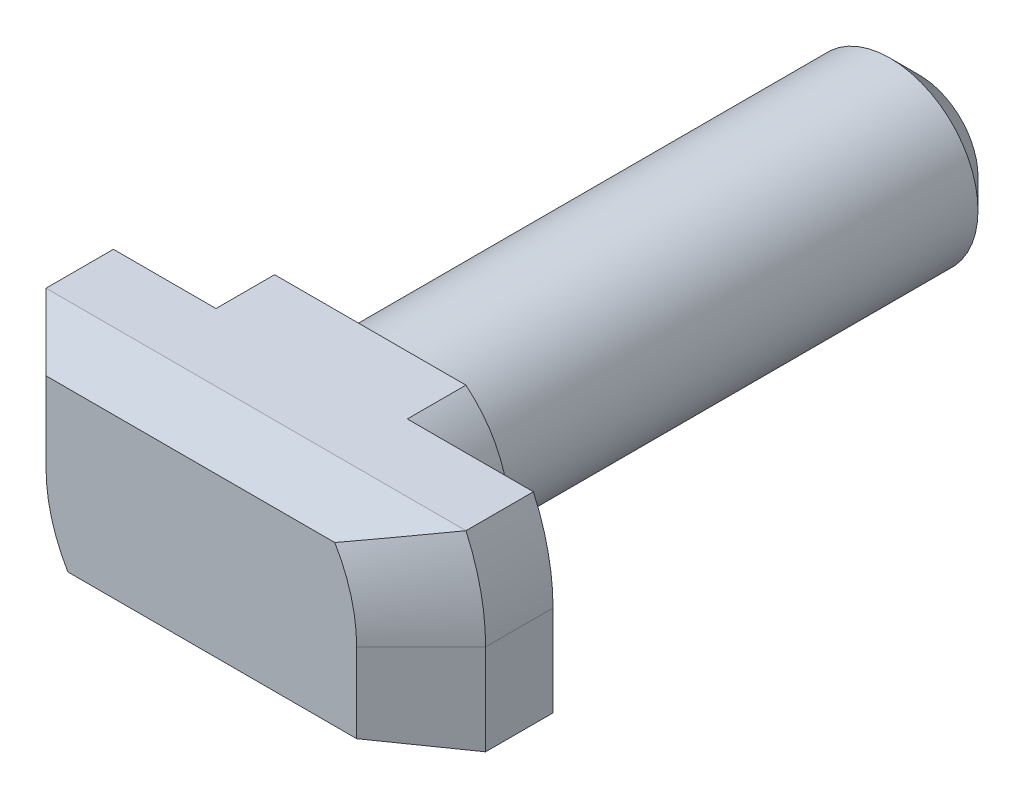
ISO-10303-21;
HEADER;
FILE_DESCRIPTION(('STEP AP214'),'2;1');
FILE_NAME('part.step','',(''),(''),'','','');
FILE_SCHEMA(('AUTOMOTIVE_DESIGN { 1 0 10303 214 1 1 1 1 }'));
ENDSEC;
DATA;
#1=APPLICATION_CONTEXT('core data for automotive mechanical design processes');
#2=APPLICATION_PROTOCOL_DEFINITION('international standard','automotive_design',2000,#1);
#3=PRODUCT_CONTEXT('',#1,'mechanical');
#4=PRODUCT('Part','Part','',(#3));
#5=PRODUCT_RELATED_PRODUCT_CATEGORY('part','',(#4));
#6=PRODUCT_DEFINITION_FORMATION('','',#4);
#7=PRODUCT_DEFINITION_CONTEXT('part definition',#1,'design');
#8=PRODUCT_DEFINITION('design','',#6,#7);
#9=PRODUCT_DEFINITION_SHAPE('','',#8);
#10=(LENGTH_UNIT() NAMED_UNIT(*) SI_UNIT(.MILLI.,.METRE.));
#11=(NAMED_UNIT(*) PLANE_ANGLE_UNIT() SI_UNIT($,.RADIAN.));
#12=(NAMED_UNIT(*) SI_UNIT($,.STERADIAN.) SOLID_ANGLE_UNIT());
#13=UNCERTAINTY_MEASURE_WITH_UNIT(LENGTH_MEASURE(1.E-05),#10,'distance_accuracy_value','');
#14=(GEOMETRIC_REPRESENTATION_CONTEXT(3) GLOBAL_UNCERTAINTY_ASSIGNED_CONTEXT((#13)) GLOBAL_UNIT_ASSIGNED_CONTEXT((#10,
#11,#12)) REPRESENTATION_CONTEXT('',''));
#15=CARTESIAN_POINT('',(0.,0.,0.));
#16=DIRECTION('',(0.,0.,1.));
#17=DIRECTION('',(1.,0.,0.));
#18=AXIS2_PLACEMENT_3D('',#15,#16,#17);
#19=CARTESIAN_POINT('',(5.30000000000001,-3.09999999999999,4.5));
#20=DIRECTION('',(0.707106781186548,0.,0.707106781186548));
#21=DIRECTION('',(0.707106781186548,0.,-0.707106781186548));
#22=AXIS2_PLACEMENT_3D('',#19,#20,#21);
#23=PLANE('',#22);
#24=DIRECTION('',(0.701673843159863,-0.123724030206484,-0.701673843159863));
#25=VECTOR('',#24,1.);
#26=CARTESIAN_POINT('',(5.30000000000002,-2.71208064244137,4.5));
#27=LINE('',#26,#25);
#28=CARTESIAN_POINT('',(5.30000000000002,-2.71208064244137,4.5));
#29=VERTEX_POINT('',#28);
#30=CARTESIAN_POINT('',(7.5,-3.09999999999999,2.3));
#31=VERTEX_POINT('',#30);
#32=EDGE_CURVE('E239',#29,#31,#27,.T.);
#33=ORIENTED_EDGE('',*,*,#32,.T.);
#34=DIRECTION('',(0.,1.,0.));
#35=VECTOR('',#34,1.);
#36=CARTESIAN_POINT('',(7.5,-3.09999999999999,2.30000000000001));
#37=LINE('',#36,#35);
#38=CARTESIAN_POINT('',(7.5,0.,2.30000000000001));
#39=VERTEX_POINT('',#38);
#40=EDGE_CURVE('E241',#39,#31,#37,.F.);
#41=ORIENTED_EDGE('',*,*,#40,.F.);
#42=DIRECTION('',(-0.707106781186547,0.,0.707106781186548));
#43=VECTOR('',#42,1.);
#44=CARTESIAN_POINT('',(7.58485620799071,0.,2.21514379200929));
#45=LINE('',#44,#43);
#46=CARTESIAN_POINT('',(5.30000000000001,0.,4.5));
#47=VERTEX_POINT('',#46);
#48=EDGE_CURVE('E103',#47,#39,#45,.F.);
#49=ORIENTED_EDGE('',*,*,#48,.F.);
#50=DIRECTION('',(0.,-1.,0.));
#51=VECTOR('',#50,1.);
#52=CARTESIAN_POINT('',(5.30000000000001,-3.09999999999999,4.5));
#53=LINE('',#52,#51);
#54=EDGE_CURVE('E271',#29,#47,#53,.F.);
#55=ORIENTED_EDGE('',*,*,#54,.F.);
#56=EDGE_LOOP('',(#33,#41,#49,#55));
#57=FACE_BOUND('',#56,.T.);
#58=ADVANCED_FACE('F16',(#57),#23,.T.);
#59=CARTESIAN_POINT('',(0.,0.,2.30000000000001));
#60=DIRECTION('',(0.,0.,-1.));
#61=DIRECTION('',(0.,1.,0.));
#62=AXIS2_PLACEMENT_3D('',#59,#60,#61);
#63=CONICAL_SURFACE('',#62,7.5,0.785398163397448);
#64=CARTESIAN_POINT('',(-6.82934843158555,-3.09999999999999,2.30000000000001));
#65=CARTESIAN_POINT('',(-6.64116901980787,-3.06741372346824,2.48480595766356));
#66=CARTESIAN_POINT('',(-6.45275253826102,-3.03486855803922,2.66937876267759));
#67=CARTESIAN_POINT('',(-6.07527016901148,-2.96989350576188,3.03787059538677));
#68=CARTESIAN_POINT('',(-5.88620429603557,-2.93746361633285,3.22178963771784));
#69=CARTESIAN_POINT('',(-5.50723735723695,-2.87275034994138,3.58879680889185));
#70=CARTESIAN_POINT('',(-5.31733628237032,-2.84046697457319,3.77188492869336));
#71=CARTESIAN_POINT('',(-4.93637796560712,-2.77610518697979,4.13689876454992));
#72=CARTESIAN_POINT('',(-4.74532069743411,-2.74402677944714,4.31882445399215));
#73=CARTESIAN_POINT('',(-4.55352814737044,-2.71208064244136,4.5));
#74=B_SPLINE_CURVE_WITH_KNOTS('',3,(#64,#65,#66,#67,#68,#69,#70,#71,#72,#73),.UNSPECIFIED.,.F.,
.F.,(4,2,2,2,4),(0.,0.797270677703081,1.59452339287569,2.39178476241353,3.1890643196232),.UNSPECIFIED.);
#75=CARTESIAN_POINT('',(-6.82934843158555,-3.09999999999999,2.30000000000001));
#76=VERTEX_POINT('',#75);
#77=CARTESIAN_POINT('',(-4.55352814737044,-2.71208064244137,4.5));
#78=VERTEX_POINT('',#77);
#79=EDGE_CURVE('E236',#76,#78,#74,.T.);
#80=ORIENTED_EDGE('',*,*,#79,.T.);
#81=CARTESIAN_POINT('',(0.,0.,4.5));
#82=DIRECTION('',(0.,0.,-1.));
#83=DIRECTION('',(0.,1.,0.));
#84=AXIS2_PLACEMENT_3D('',#81,#82,#83);
#85=CIRCLE('',#84,5.30000000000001);
#86=CARTESIAN_POINT('',(-5.3,0.,4.5));
#87=VERTEX_POINT('',#86);
#88=EDGE_CURVE('E19',#87,#78,#85,.F.);
#89=ORIENTED_EDGE('',*,*,#88,.F.);
#90=DIRECTION('',(0.707106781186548,0.,0.707106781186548));
#91=VECTOR('',#90,1.);
#92=CARTESIAN_POINT('',(-7.5,0.,2.3));
#93=LINE('',#92,#91);
#94=CARTESIAN_POINT('',(-7.5,0.,2.30000000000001));
#95=VERTEX_POINT('',#94);
#96=EDGE_CURVE('E268',#95,#87,#93,.T.);
#97=ORIENTED_EDGE('',*,*,#96,.F.);
#98=CARTESIAN_POINT('',(0.,0.,2.30000000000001));
#99=DIRECTION('',(0.,0.,-1.));
#100=DIRECTION('',(0.,1.,0.));
#101=AXIS2_PLACEMENT_3D('',#98,#99,#100);
#102=CIRCLE('',#101,7.5);
#103=EDGE_CURVE('E222',#76,#95,#102,.T.);
#104=ORIENTED_EDGE('',*,*,#103,.F.);
#105=EDGE_LOOP('',(#80,#89,#97,#104));
#106=FACE_BOUND('',#105,.T.);
#107=ADVANCED_FACE('F328',(#106),#63,.T.);
#108=CARTESIAN_POINT('',(-5.30000000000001,-3.09999999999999,4.5));
#109=DIRECTION('',(0.,0.,1.));
#110=DIRECTION('',(0.,-1.,0.));
#111=AXIS2_PLACEMENT_3D('',#108,#109,#110);
#112=PLANE('',#111);
#113=CARTESIAN_POINT('',(0.,0.,4.5));
#114=DIRECTION('',(0.,0.,-1.));
#115=DIRECTION('',(0.,1.,0.));
#116=AXIS2_PLACEMENT_3D('',#113,#114,#115);
#117=CIRCLE('',#116,5.3);
#118=CARTESIAN_POINT('',(4.55352814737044,2.71208064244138,4.5));
#119=VERTEX_POINT('',#118);
#120=EDGE_CURVE('E282',#119,#47,#117,.T.);
#121=ORIENTED_EDGE('',*,*,#120,.F.);
#122=DIRECTION('',(1.,0.,0.));
#123=VECTOR('',#122,1.);
#124=CARTESIAN_POINT('',(-8.7000480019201,2.71208064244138,4.5));
#125=LINE('',#124,#123);
#126=CARTESIAN_POINT('',(-5.3,2.71208064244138,4.5));
#127=VERTEX_POINT('',#126);
#128=EDGE_CURVE('E191',#127,#119,#125,.T.);
#129=ORIENTED_EDGE('',*,*,#128,.F.);
#130=DIRECTION('',(0.,1.,0.));
#131=VECTOR('',#130,1.);
#132=CARTESIAN_POINT('',(-5.3,-3.09999999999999,4.5));
#133=LINE('',#132,#131);
#134=EDGE_CURVE('E263',#87,#127,#133,.T.);
#135=ORIENTED_EDGE('',*,*,#134,.F.);
#136=ORIENTED_EDGE('',*,*,#88,.T.);
#137=DIRECTION('',(1.,0.,0.));
#138=VECTOR('',#137,1.);
#139=CARTESIAN_POINT('',(-8.02939643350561,-2.71208064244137,4.5));
#140=LINE('',#139,#138);
#141=EDGE_CURVE('E226',#78,#29,#140,.T.);
#142=ORIENTED_EDGE('',*,*,#141,.T.);
#143=ORIENTED_EDGE('',*,*,#54,.T.);
#144=EDGE_LOOP('',(#121,#129,#135,#136,#142,#143));
#145=FACE_BOUND('',#144,.T.);
#146=ADVANCED_FACE('F325',(#145),#112,.T.);
#147=CARTESIAN_POINT('',(0.,0.,2.3));
#148=DIRECTION('',(0.,0.,-1.));
#149=DIRECTION('',(0.,1.,0.));
#150=AXIS2_PLACEMENT_3D('',#147,#148,#149);
#151=CONICAL_SURFACE('',#150,7.5,0.785398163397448);
#152=CARTESIAN_POINT('',(4.55352814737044,2.71208064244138,4.5));
#153=CARTESIAN_POINT('',(4.74532069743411,2.74402677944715,4.31882445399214));
#154=CARTESIAN_POINT('',(4.93637796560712,2.77610518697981,4.13689876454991));
#155=CARTESIAN_POINT('',(5.31733628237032,2.84046697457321,3.77188492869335));
#156=CARTESIAN_POINT('',(5.50723735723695,2.8727503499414,3.58879680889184));
#157=CARTESIAN_POINT('',(5.88620429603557,2.93746361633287,3.22178963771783));
#158=CARTESIAN_POINT('',(6.07527016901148,2.9698935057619,3.03787059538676));
#159=CARTESIAN_POINT('',(6.45275253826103,3.03486855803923,2.66937876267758));
#160=CARTESIAN_POINT('',(6.64116901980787,3.06741372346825,2.48480595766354));
#161=CARTESIAN_POINT('',(6.82934843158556,3.1,2.3));
#162=B_SPLINE_CURVE_WITH_KNOTS('',3,(#152,#153,#154,#155,#156,#157,#158,#159,#160,#161),
.UNSPECIFIED.,.F.,.F.,(4,2,2,2,4),(0.,0.797279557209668,1.59454092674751,2.39179364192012,
3.18906431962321),.UNSPECIFIED.);
#163=CARTESIAN_POINT('',(6.82934843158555,3.1,2.29999999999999));
#164=VERTEX_POINT('',#163);
#165=EDGE_CURVE('E194',#119,#164,#162,.T.);
#166=ORIENTED_EDGE('',*,*,#165,.F.);
#167=ORIENTED_EDGE('',*,*,#120,.T.);
#168=ORIENTED_EDGE('',*,*,#48,.T.);
#169=CARTESIAN_POINT('',(0.,0.,2.3));
#170=DIRECTION('',(0.,0.,-1.));
#171=DIRECTION('',(0.,1.,0.));
#172=AXIS2_PLACEMENT_3D('',#169,#170,#171);
#173=CIRCLE('',#172,7.5);
#174=EDGE_CURVE('E259',#164,#39,#173,.T.);
#175=ORIENTED_EDGE('',*,*,#174,.F.);
#176=EDGE_LOOP('',(#166,#167,#168,#175));
#177=FACE_BOUND('',#176,.T.);
#178=ADVANCED_FACE('F319',(#177),#151,.T.);
#179=CARTESIAN_POINT('',(-7.5,-3.09999999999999,2.3));
#180=DIRECTION('',(-0.707106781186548,0.,0.707106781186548));
#181=DIRECTION('',(0.707106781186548,0.,0.707106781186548));
#182=AXIS2_PLACEMENT_3D('',#179,#180,#181);
#183=PLANE('',#182);
#184=DIRECTION('',(0.701673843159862,-0.123724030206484,0.701673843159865));
#185=VECTOR('',#184,1.);
#186=CARTESIAN_POINT('',(-7.50000000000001,3.1,2.29999999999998));
#187=LINE('',#186,#185);
#188=CARTESIAN_POINT('',(-7.5,3.1,2.29999999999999));
#189=VERTEX_POINT('',#188);
#190=EDGE_CURVE('E178',#189,#127,#187,.T.);
#191=ORIENTED_EDGE('',*,*,#190,.F.);
#192=DIRECTION('',(0.,1.,0.));
#193=VECTOR('',#192,1.);
#194=CARTESIAN_POINT('',(-7.5,3.1,2.30000000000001));
#195=LINE('',#194,#193);
#196=EDGE_CURVE('E204',#95,#189,#195,.T.);
#197=ORIENTED_EDGE('',*,*,#196,.F.);
#198=ORIENTED_EDGE('',*,*,#96,.T.);
#199=ORIENTED_EDGE('',*,*,#134,.T.);
#200=EDGE_LOOP('',(#191,#197,#198,#199));
#201=FACE_BOUND('',#200,.T.);
#202=ADVANCED_FACE('F324',(#201),#183,.T.);
#203=CARTESIAN_POINT('',(7.5,-3.09999999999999,0.5));
#204=DIRECTION('',(1.,0.,0.));
#205=DIRECTION('',(0.,0.,-1.));
#206=AXIS2_PLACEMENT_3D('',#203,#204,#205);
#207=PLANE('',#206);
#208=DIRECTION('',(0.,0.,-1.));
#209=VECTOR('',#208,1.);
#210=CARTESIAN_POINT('',(7.5,-3.09999999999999,0.));
#211=LINE('',#210,#209);
#212=CARTESIAN_POINT('',(7.5,-3.09999999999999,0.));
#213=VERTEX_POINT('',#212);
#214=EDGE_CURVE('E231',#213,#31,#211,.F.);
#215=ORIENTED_EDGE('',*,*,#214,.F.);
#216=DIRECTION('',(0.,-1.,0.));
#217=VECTOR('',#216,1.);
#218=CARTESIAN_POINT('',(7.5,3.1,0.));
#219=LINE('',#218,#217);
#220=CARTESIAN_POINT('',(7.5,0.,0.));
#221=VERTEX_POINT('',#220);
#222=EDGE_CURVE('E175',#213,#221,#219,.F.);
#223=ORIENTED_EDGE('',*,*,#222,.T.);
#224=DIRECTION('',(0.,0.,-1.));
#225=VECTOR('',#224,1.);
#226=CARTESIAN_POINT('',(7.5,0.,0.5));
#227=LINE('',#226,#225);
#228=EDGE_CURVE('E250',#221,#39,#227,.F.);
#229=ORIENTED_EDGE('',*,*,#228,.T.);
#230=ORIENTED_EDGE('',*,*,#40,.T.);
#231=EDGE_LOOP('',(#215,#223,#229,#230));
#232=FACE_BOUND('',#231,.T.);
#233=ADVANCED_FACE('F342',(#232),#207,.T.);
#234=CARTESIAN_POINT('',(-8.02939643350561,-3.09999999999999,2.3));
#235=DIRECTION('',(0.,0.984807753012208,-0.173648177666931));
#236=DIRECTION('',(0.,0.173648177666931,0.984807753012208));
#237=AXIS2_PLACEMENT_3D('',#234,#235,#236);
#238=PLANE('',#237);
#239=ORIENTED_EDGE('',*,*,#79,.F.);
#240=DIRECTION('',(1.,0.,0.));
#241=VECTOR('',#240,1.);
#242=CARTESIAN_POINT('',(-2.52784493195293,-3.09999999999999,2.3));
#243=LINE('',#242,#241);
#244=EDGE_CURVE('E221',#31,#76,#243,.F.);
#245=ORIENTED_EDGE('',*,*,#244,.F.);
#246=ORIENTED_EDGE('',*,*,#32,.F.);
#247=ORIENTED_EDGE('',*,*,#141,.F.);
#248=EDGE_LOOP('',(#239,#245,#246,#247));
#249=FACE_BOUND('',#248,.T.);
#250=ADVANCED_FACE('F337',(#249),#238,.F.);
#251=CARTESIAN_POINT('',(0.,0.,0.5));
#252=DIRECTION('',(0.,0.,-1.));
#253=DIRECTION('',(0.,1.,0.));
#254=AXIS2_PLACEMENT_3D('',#251,#252,#253);
#255=CYLINDRICAL_SURFACE('',#254,7.5);
#256=DIRECTION('',(0.,0.,1.));
#257=VECTOR('',#256,1.);
#258=CARTESIAN_POINT('',(-7.5,0.,0.5));
#259=LINE('',#258,#257);
#260=CARTESIAN_POINT('',(-7.5,0.,0.));
#261=VERTEX_POINT('',#260);
#262=EDGE_CURVE('E207',#261,#95,#259,.T.);
#263=ORIENTED_EDGE('',*,*,#262,.F.);
#264=CARTESIAN_POINT('',(0.,0.,0.));
#265=DIRECTION('',(0.,0.,-1.));
#266=DIRECTION('',(0.,1.,0.));
#267=AXIS2_PLACEMENT_3D('',#264,#265,#266);
#268=CIRCLE('',#267,7.5);
#269=CARTESIAN_POINT('',(-6.82934843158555,-3.09999999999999,0.));
#270=VERTEX_POINT('',#269);
#271=EDGE_CURVE('E225',#261,#270,#268,.F.);
#272=ORIENTED_EDGE('',*,*,#271,.T.);
#273=DIRECTION('',(0.,0.,-1.));
#274=VECTOR('',#273,1.);
#275=CARTESIAN_POINT('',(-6.82934843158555,-3.09999999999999,0.));
#276=LINE('',#275,#274);
#277=EDGE_CURVE('E218',#76,#270,#276,.T.);
#278=ORIENTED_EDGE('',*,*,#277,.F.);
#279=ORIENTED_EDGE('',*,*,#103,.T.);
#280=EDGE_LOOP('',(#263,#272,#278,#279));
#281=FACE_BOUND('',#280,.T.);
#282=ADVANCED_FACE('F341',(#281),#255,.T.);
#283=CARTESIAN_POINT('',(7.5,3.1,0.));
#284=DIRECTION('',(0.,0.,1.));
#285=DIRECTION('',(0.,-1.,0.));
#286=AXIS2_PLACEMENT_3D('',#283,#284,#285);
#287=PLANE('',#286);
#288=ORIENTED_EDGE('',*,*,#271,.F.);
#289=DIRECTION('',(0.,1.,0.));
#290=VECTOR('',#289,1.);
#291=CARTESIAN_POINT('',(-7.5,3.1,0.));
#292=LINE('',#291,#290);
#293=CARTESIAN_POINT('',(-7.5,3.1,0.));
#294=VERTEX_POINT('',#293);
#295=EDGE_CURVE('E143',#294,#261,#292,.F.);
#296=ORIENTED_EDGE('',*,*,#295,.F.);
#297=DIRECTION('',(1.,0.,0.));
#298=VECTOR('',#297,1.);
#299=CARTESIAN_POINT('',(2.52784493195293,3.1,0.));
#300=LINE('',#299,#298);
#301=CARTESIAN_POINT('',(-4.,3.1,0.));
#302=VERTEX_POINT('',#301);
#303=EDGE_CURVE('E139',#302,#294,#300,.F.);
#304=ORIENTED_EDGE('',*,*,#303,.F.);
#305=DIRECTION('',(0.,1.,0.));
#306=VECTOR('',#305,1.);
#307=CARTESIAN_POINT('',(-4.,3.1,0.));
#308=LINE('',#307,#306);
#309=CARTESIAN_POINT('',(-4.,0.,0.));
#310=VERTEX_POINT('',#309);
#311=EDGE_CURVE('E128',#310,#302,#308,.T.);
#312=ORIENTED_EDGE('',*,*,#311,.F.);
#313=CARTESIAN_POINT('',(0.,0.,0.));
#314=DIRECTION('',(0.,0.,-1.));
#315=DIRECTION('',(0.,1.,0.));
#316=AXIS2_PLACEMENT_3D('',#313,#314,#315);
#317=CIRCLE('',#316,4.);
#318=CARTESIAN_POINT('',(-2.52784493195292,-3.09999999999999,0.));
#319=VERTEX_POINT('',#318);
#320=EDGE_CURVE('E159',#319,#310,#317,.T.);
#321=ORIENTED_EDGE('',*,*,#320,.F.);
#322=DIRECTION('',(1.,0.,0.));
#323=VECTOR('',#322,1.);
#324=CARTESIAN_POINT('',(-2.52784493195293,-3.09999999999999,0.));
#325=LINE('',#324,#323);
#326=EDGE_CURVE('E163',#270,#319,#325,.T.);
#327=ORIENTED_EDGE('',*,*,#326,.F.);
#328=EDGE_LOOP('',(#288,#296,#304,#312,#321,#327));
#329=FACE_BOUND('',#328,.T.);
#330=ADVANCED_FACE('F141',(#329),#287,.F.);
#331=CARTESIAN_POINT('',(-7.5,3.1,0.5));
#332=DIRECTION('',(-1.,0.,0.));
#333=DIRECTION('',(0.,0.,1.));
#334=AXIS2_PLACEMENT_3D('',#331,#332,#333);
#335=PLANE('',#334);
#336=DIRECTION('',(0.,0.,1.));
#337=VECTOR('',#336,1.);
#338=CARTESIAN_POINT('',(-7.5,3.1,0.));
#339=LINE('',#338,#337);
#340=EDGE_CURVE('E146',#294,#189,#339,.T.);
#341=ORIENTED_EDGE('',*,*,#340,.F.);
#342=ORIENTED_EDGE('',*,*,#295,.T.);
#343=ORIENTED_EDGE('',*,*,#262,.T.);
#344=ORIENTED_EDGE('',*,*,#196,.T.);
#345=EDGE_LOOP('',(#341,#342,#343,#344));
#346=FACE_BOUND('',#345,.T.);
#347=ADVANCED_FACE('F403',(#346),#335,.T.);
#348=CARTESIAN_POINT('',(-8.7000480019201,3.1,2.3));
#349=DIRECTION('',(0.,0.984807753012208,0.17364817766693));
#350=DIRECTION('',(0.,-0.17364817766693,0.984807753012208));
#351=AXIS2_PLACEMENT_3D('',#348,#349,#350);
#352=PLANE('',#351);
#353=DIRECTION('',(1.,0.,0.));
#354=VECTOR('',#353,1.);
#355=CARTESIAN_POINT('',(2.52784493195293,3.1,2.29999999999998));
#356=LINE('',#355,#354);
#357=EDGE_CURVE('E186',#189,#164,#356,.T.);
#358=ORIENTED_EDGE('',*,*,#357,.F.);
#359=ORIENTED_EDGE('',*,*,#190,.T.);
#360=ORIENTED_EDGE('',*,*,#128,.T.);
#361=ORIENTED_EDGE('',*,*,#165,.T.);
#362=EDGE_LOOP('',(#358,#359,#360,#361));
#363=FACE_BOUND('',#362,.T.);
#364=ADVANCED_FACE('F315',(#363),#352,.T.);
#365=CARTESIAN_POINT('',(0.,0.,0.5));
#366=DIRECTION('',(0.,0.,-1.));
#367=DIRECTION('',(0.,1.,0.));
#368=AXIS2_PLACEMENT_3D('',#365,#366,#367);
#369=CYLINDRICAL_SURFACE('',#368,7.5);
#370=DIRECTION('',(0.,0.,1.));
#371=VECTOR('',#370,1.);
#372=CARTESIAN_POINT('',(6.82934843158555,3.1,0.));
#373=LINE('',#372,#371);
#374=CARTESIAN_POINT('',(6.82934843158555,3.1,0.));
#375=VERTEX_POINT('',#374);
#376=EDGE_CURVE('E183',#164,#375,#373,.F.);
#377=ORIENTED_EDGE('',*,*,#376,.F.);
#378=ORIENTED_EDGE('',*,*,#174,.T.);
#379=ORIENTED_EDGE('',*,*,#228,.F.);
#380=CARTESIAN_POINT('',(0.,0.,0.));
#381=DIRECTION('',(0.,0.,-1.));
#382=DIRECTION('',(0.,1.,0.));
#383=AXIS2_PLACEMENT_3D('',#380,#381,#382);
#384=CIRCLE('',#383,7.5);
#385=EDGE_CURVE('E172',#221,#375,#384,.F.);
#386=ORIENTED_EDGE('',*,*,#385,.T.);
#387=EDGE_LOOP('',(#377,#378,#379,#386));
#388=FACE_BOUND('',#387,.T.);
#389=ADVANCED_FACE('F396',(#388),#369,.T.);
#390=CARTESIAN_POINT('',(7.5,3.1,0.));
#391=DIRECTION('',(0.,0.,1.));
#392=DIRECTION('',(0.,-1.,0.));
#393=AXIS2_PLACEMENT_3D('',#390,#391,#392);
#394=PLANE('',#393);
#395=DIRECTION('',(1.,0.,0.));
#396=VECTOR('',#395,1.);
#397=CARTESIAN_POINT('',(2.52784493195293,3.1,0.));
#398=LINE('',#397,#396);
#399=CARTESIAN_POINT('',(2.52784493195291,3.1,0.));
#400=VERTEX_POINT('',#399);
#401=EDGE_CURVE('E181',#375,#400,#398,.F.);
#402=ORIENTED_EDGE('',*,*,#401,.F.);
#403=ORIENTED_EDGE('',*,*,#385,.F.);
#404=ORIENTED_EDGE('',*,*,#222,.F.);
#405=DIRECTION('',(1.,0.,0.));
#406=VECTOR('',#405,1.);
#407=CARTESIAN_POINT('',(-2.52784493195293,-3.09999999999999,0.));
#408=LINE('',#407,#406);
#409=CARTESIAN_POINT('',(4.,-3.09999999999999,0.));
#410=VERTEX_POINT('',#409);
#411=EDGE_CURVE('E167',#410,#213,#408,.T.);
#412=ORIENTED_EDGE('',*,*,#411,.F.);
#413=DIRECTION('',(0.,1.,0.));
#414=VECTOR('',#413,1.);
#415=CARTESIAN_POINT('',(4.,-3.09999999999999,0.));
#416=LINE('',#415,#414);
#417=CARTESIAN_POINT('',(4.,0.,0.));
#418=VERTEX_POINT('',#417);
#419=EDGE_CURVE('E168',#418,#410,#416,.F.);
#420=ORIENTED_EDGE('',*,*,#419,.F.);
#421=CARTESIAN_POINT('',(0.,0.,0.));
#422=DIRECTION('',(0.,0.,-1.));
#423=DIRECTION('',(0.,1.,0.));
#424=AXIS2_PLACEMENT_3D('',#421,#422,#423);
#425=CIRCLE('',#424,4.);
#426=EDGE_CURVE('E301',#400,#418,#425,.T.);
#427=ORIENTED_EDGE('',*,*,#426,.F.);
#428=EDGE_LOOP('',(#402,#403,#404,#412,#420,#427));
#429=FACE_BOUND('',#428,.T.);
#430=ADVANCED_FACE('F393',(#429),#394,.F.);
#431=CARTESIAN_POINT('',(0.,0.,-20.));
#432=DIRECTION('',(0.,0.,1.));
#433=DIRECTION('',(0.,-1.,0.));
#434=AXIS2_PLACEMENT_3D('',#431,#432,#433);
#435=PLANE('',#434);
#436=CARTESIAN_POINT('',(0.,0.,-19.999999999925));
#437=DIRECTION('',(0.,0.,1.));
#438=DIRECTION('',(1.,0.,0.));
#439=AXIS2_PLACEMENT_3D('',#436,#437,#438);
#440=CIRCLE('',#439,2.00000000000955);
#441=CARTESIAN_POINT('',(2.00000000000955,0.,-19.999999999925));
#442=VERTEX_POINT('',#441);
#443=EDGE_CURVE('E296',#442,#442,#440,.T.);
#444=ORIENTED_EDGE('',*,*,#443,.F.);
#445=EDGE_LOOP('',(#444));
#446=FACE_BOUND('',#445,.T.);
#447=ADVANCED_FACE('F389',(#446),#435,.F.);
#448=CARTESIAN_POINT('',(4.,-3.09999999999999,0.));
#449=DIRECTION('',(1.,0.,0.));
#450=DIRECTION('',(0.,0.,-1.));
#451=AXIS2_PLACEMENT_3D('',#448,#449,#450);
#452=PLANE('',#451);
#453=DIRECTION('',(0.,0.,-1.));
#454=VECTOR('',#453,1.);
#455=CARTESIAN_POINT('',(4.,-3.09999999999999,0.));
#456=LINE('',#455,#454);
#457=CARTESIAN_POINT('',(4.,-3.09999999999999,-2.));
#458=VERTEX_POINT('',#457);
#459=EDGE_CURVE('E164',#458,#410,#456,.F.);
#460=ORIENTED_EDGE('',*,*,#459,.F.);
#461=DIRECTION('',(0.,1.,0.));
#462=VECTOR('',#461,1.);
#463=CARTESIAN_POINT('',(4.,-3.09999999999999,-2.));
#464=LINE('',#463,#462);
#465=CARTESIAN_POINT('',(4.,0.,-2.));
#466=VERTEX_POINT('',#465);
#467=EDGE_CURVE('E299',#466,#458,#464,.F.);
#468=ORIENTED_EDGE('',*,*,#467,.F.);
#469=DIRECTION('',(0.,0.,-1.));
#470=VECTOR('',#469,1.);
#471=CARTESIAN_POINT('',(4.,0.,0.));
#472=LINE('',#471,#470);
#473=EDGE_CURVE('E300',#418,#466,#472,.T.);
#474=ORIENTED_EDGE('',*,*,#473,.F.);
#475=ORIENTED_EDGE('',*,*,#419,.T.);
#476=EDGE_LOOP('',(#460,#468,#474,#475));
#477=FACE_BOUND('',#476,.T.);
#478=ADVANCED_FACE('F385',(#477),#452,.T.);
#479=CARTESIAN_POINT('',(-2.52784493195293,-3.09999999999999,0.));
#480=DIRECTION('',(0.,-1.,0.));
#481=DIRECTION('',(0.,0.,-1.));
#482=AXIS2_PLACEMENT_3D('',#479,#480,#481);
#483=PLANE('',#482);
#484=DIRECTION('',(0.,0.,-1.));
#485=VECTOR('',#484,1.);
#486=CARTESIAN_POINT('',(-2.52784493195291,-3.1,0.));
#487=LINE('',#486,#485);
#488=CARTESIAN_POINT('',(-2.52784493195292,-3.09999999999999,-2.));
#489=VERTEX_POINT('',#488);
#490=EDGE_CURVE('E160',#489,#319,#487,.F.);
#491=ORIENTED_EDGE('',*,*,#490,.F.);
#492=DIRECTION('',(1.,0.,0.));
#493=VECTOR('',#492,1.);
#494=CARTESIAN_POINT('',(-3.10000000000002,-3.09999999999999,-2.));
#495=LINE('',#494,#493);
#496=EDGE_CURVE('E295',#458,#489,#495,.F.);
#497=ORIENTED_EDGE('',*,*,#496,.F.);
#498=ORIENTED_EDGE('',*,*,#459,.T.);
#499=ORIENTED_EDGE('',*,*,#411,.T.);
#500=ORIENTED_EDGE('',*,*,#214,.T.);
#501=ORIENTED_EDGE('',*,*,#244,.T.);
#502=ORIENTED_EDGE('',*,*,#277,.T.);
#503=ORIENTED_EDGE('',*,*,#326,.T.);
#504=EDGE_LOOP('',(#491,#497,#498,#499,#500,#501,#502,#503));
#505=FACE_BOUND('',#504,.T.);
#506=ADVANCED_FACE('F381',(#505),#483,.T.);
#507=CARTESIAN_POINT('',(0.,0.,0.));
#508=DIRECTION('',(0.,0.,-1.));
#509=DIRECTION('',(0.,1.,0.));
#510=AXIS2_PLACEMENT_3D('',#507,#508,#509);
#511=CYLINDRICAL_SURFACE('',#510,4.);
#512=DIRECTION('',(0.,0.,1.));
#513=VECTOR('',#512,1.);
#514=CARTESIAN_POINT('',(-4.,0.,0.));
#515=LINE('',#514,#513);
#516=CARTESIAN_POINT('',(-4.,0.,-2.));
#517=VERTEX_POINT('',#516);
#518=EDGE_CURVE('E134',#517,#310,#515,.T.);
#519=ORIENTED_EDGE('',*,*,#518,.F.);
#520=CARTESIAN_POINT('',(0.,0.,-2.));
#521=DIRECTION('',(0.,0.,-1.));
#522=DIRECTION('',(0.,1.,0.));
#523=AXIS2_PLACEMENT_3D('',#520,#521,#522);
#524=CIRCLE('',#523,4.);
#525=EDGE_CURVE('E291',#489,#517,#524,.T.);
#526=ORIENTED_EDGE('',*,*,#525,.F.);
#527=ORIENTED_EDGE('',*,*,#490,.T.);
#528=ORIENTED_EDGE('',*,*,#320,.T.);
#529=EDGE_LOOP('',(#519,#526,#527,#528));
#530=FACE_BOUND('',#529,.T.);
#531=ADVANCED_FACE('F378',(#530),#511,.T.);
#532=CARTESIAN_POINT('',(-4.,3.1,0.));
#533=DIRECTION('',(-1.,0.,0.));
#534=DIRECTION('',(0.,0.,1.));
#535=AXIS2_PLACEMENT_3D('',#532,#533,#534);
#536=PLANE('',#535);
#537=DIRECTION('',(0.,0.,1.));
#538=VECTOR('',#537,1.);
#539=CARTESIAN_POINT('',(-4.,3.1,0.));
#540=LINE('',#539,#538);
#541=CARTESIAN_POINT('',(-4.,3.1,-2.));
#542=VERTEX_POINT('',#541);
#543=EDGE_CURVE('E133',#542,#302,#540,.T.);
#544=ORIENTED_EDGE('',*,*,#543,.F.);
#545=DIRECTION('',(0.,1.,0.));
#546=VECTOR('',#545,1.);
#547=CARTESIAN_POINT('',(-4.,-3.09999999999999,-2.));
#548=LINE('',#547,#546);
#549=EDGE_CURVE('E294',#517,#542,#548,.T.);
#550=ORIENTED_EDGE('',*,*,#549,.F.);
#551=ORIENTED_EDGE('',*,*,#518,.T.);
#552=ORIENTED_EDGE('',*,*,#311,.T.);
#553=EDGE_LOOP('',(#544,#550,#551,#552));
#554=FACE_BOUND('',#553,.T.);
#555=ADVANCED_FACE('F130',(#554),#536,.T.);
#556=CARTESIAN_POINT('',(2.52784493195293,3.1,0.));
#557=DIRECTION('',(0.,1.,0.));
#558=DIRECTION('',(0.,0.,1.));
#559=AXIS2_PLACEMENT_3D('',#556,#557,#558);
#560=PLANE('',#559);
#561=DIRECTION('',(0.,0.,-1.));
#562=VECTOR('',#561,1.);
#563=CARTESIAN_POINT('',(2.52784493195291,3.1,0.));
#564=LINE('',#563,#562);
#565=CARTESIAN_POINT('',(2.52784493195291,3.1,-2.));
#566=VERTEX_POINT('',#565);
#567=EDGE_CURVE('E34',#566,#400,#564,.F.);
#568=ORIENTED_EDGE('',*,*,#567,.F.);
#569=DIRECTION('',(1.,0.,0.));
#570=VECTOR('',#569,1.);
#571=CARTESIAN_POINT('',(-3.10000000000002,3.1,-2.));
#572=LINE('',#571,#570);
#573=EDGE_CURVE('E150',#542,#566,#572,.T.);
#574=ORIENTED_EDGE('',*,*,#573,.F.);
#575=ORIENTED_EDGE('',*,*,#543,.T.);
#576=ORIENTED_EDGE('',*,*,#303,.T.);
#577=ORIENTED_EDGE('',*,*,#340,.T.);
#578=ORIENTED_EDGE('',*,*,#357,.T.);
#579=ORIENTED_EDGE('',*,*,#376,.T.);
#580=ORIENTED_EDGE('',*,*,#401,.T.);
#581=EDGE_LOOP('',(#568,#574,#575,#576,#577,#578,#579,#580));
#582=FACE_BOUND('',#581,.T.);
#583=ADVANCED_FACE('F148',(#582),#560,.T.);
#584=CARTESIAN_POINT('',(0.,0.,0.));
#585=DIRECTION('',(0.,0.,-1.));
#586=DIRECTION('',(0.,1.,0.));
#587=AXIS2_PLACEMENT_3D('',#584,#585,#586);
#588=CYLINDRICAL_SURFACE('',#587,4.);
#589=ORIENTED_EDGE('',*,*,#473,.T.);
#590=CARTESIAN_POINT('',(0.,0.,-2.));
#591=DIRECTION('',(0.,0.,-1.));
#592=DIRECTION('',(0.,1.,0.));
#593=AXIS2_PLACEMENT_3D('',#590,#591,#592);
#594=CIRCLE('',#593,4.);
#595=EDGE_CURVE('E288',#566,#466,#594,.T.);
#596=ORIENTED_EDGE('',*,*,#595,.F.);
#597=ORIENTED_EDGE('',*,*,#567,.T.);
#598=ORIENTED_EDGE('',*,*,#426,.T.);
#599=EDGE_LOOP('',(#589,#596,#597,#598));
#600=FACE_BOUND('',#599,.T.);
#601=ADVANCED_FACE('F369',(#600),#588,.T.);
#602=CARTESIAN_POINT('',(0.,0.,-19.0000000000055));
#603=DIRECTION('',(0.,0.,1.));
#604=DIRECTION('',(1.,0.,0.));
#605=AXIS2_PLACEMENT_3D('',#602,#603,#604);
#606=CONICAL_SURFACE('',#605,2.99999999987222,0.785398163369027);
#607=CARTESIAN_POINT('',(0.,0.,-19.));
#608=DIRECTION('',(0.,0.,-1.));
#609=DIRECTION('',(0.,1.,0.));
#610=AXIS2_PLACEMENT_3D('',#607,#608,#609);
#611=CIRCLE('',#610,3.);
#612=CARTESIAN_POINT('',(0.,3.,-19.));
#613=VERTEX_POINT('',#612);
#614=EDGE_CURVE('E25',#613,#613,#611,.F.);
#615=ORIENTED_EDGE('',*,*,#614,.F.);
#616=EDGE_LOOP('',(#615));
#617=FACE_BOUND('',#616,.T.);
#618=ORIENTED_EDGE('',*,*,#443,.T.);
#619=EDGE_LOOP('',(#618));
#620=FACE_BOUND('',#619,.T.);
#621=ADVANCED_FACE('F361',(#617,#620),#606,.T.);
#622=CARTESIAN_POINT('',(-3.10000000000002,-3.09999999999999,-2.));
#623=DIRECTION('',(0.,0.,-1.));
#624=DIRECTION('',(0.,1.,0.));
#625=AXIS2_PLACEMENT_3D('',#622,#623,#624);
#626=PLANE('',#625);
#627=CARTESIAN_POINT('',(0.,0.,-2.));
#628=DIRECTION('',(0.,0.,-1.));
#629=DIRECTION('',(0.,1.,0.));
#630=AXIS2_PLACEMENT_3D('',#627,#628,#629);
#631=CIRCLE('',#630,3.);
#632=CARTESIAN_POINT('',(0.,3.,-2.));
#633=VERTEX_POINT('',#632);
#634=EDGE_CURVE('E10',#633,#633,#631,.T.);
#635=ORIENTED_EDGE('',*,*,#634,.F.);
#636=EDGE_LOOP('',(#635));
#637=FACE_BOUND('',#636,.T.);
#638=ORIENTED_EDGE('',*,*,#573,.T.);
#639=ORIENTED_EDGE('',*,*,#595,.T.);
#640=ORIENTED_EDGE('',*,*,#467,.T.);
#641=ORIENTED_EDGE('',*,*,#496,.T.);
#642=ORIENTED_EDGE('',*,*,#525,.T.);
#643=ORIENTED_EDGE('',*,*,#549,.T.);
#644=EDGE_LOOP('',(#638,#639,#640,#641,#642,#643));
#645=FACE_BOUND('',#644,.T.);
#646=ADVANCED_FACE('F355',(#637,#645),#626,.T.);
#647=CARTESIAN_POINT('',(0.,0.,-2.));
#648=DIRECTION('',(0.,0.,-1.));
#649=DIRECTION('',(0.,1.,0.));
#650=AXIS2_PLACEMENT_3D('',#647,#648,#649);
#651=CYLINDRICAL_SURFACE('',#650,3.);
#652=ORIENTED_EDGE('',*,*,#614,.T.);
#653=EDGE_LOOP('',(#652));
#654=FACE_BOUND('',#653,.T.);
#655=ORIENTED_EDGE('',*,*,#634,.T.);
#656=EDGE_LOOP('',(#655));
#657=FACE_BOUND('',#656,.T.);
#658=ADVANCED_FACE('F353',(#654,#657),#651,.T.);
#659=CLOSED_SHELL('',(#58,#107,#146,#178,#202,#233,#250,#282,#330,#347,#364,#389,#430,#447,#478,
#506,#531,#555,#583,#601,#621,#646,#658));
#660=MANIFOLD_SOLID_BREP('B1',#659);
#661=ADVANCED_BREP_SHAPE_REPRESENTATION('',(#18,#660),#14);
#662=SHAPE_DEFINITION_REPRESENTATION(#9,#661);
ENDSEC;
END-ISO-10303-21;
